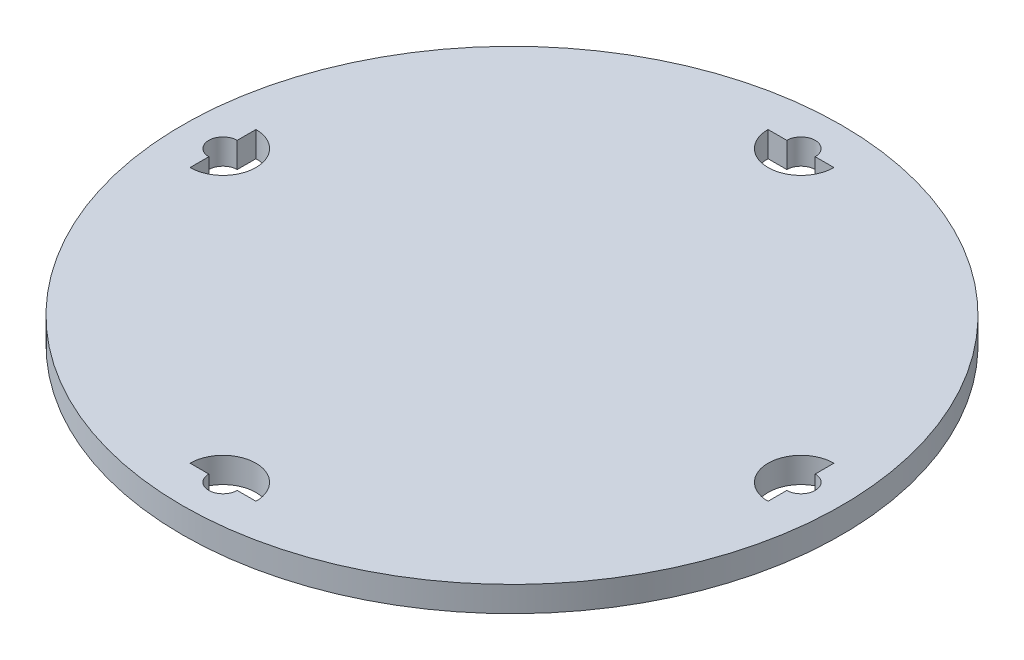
ISO-10303-21;
HEADER;
FILE_DESCRIPTION(('STEP AP214'),'2;1');
FILE_NAME('part.step','',(''),(''),'','','');
FILE_SCHEMA(('AUTOMOTIVE_DESIGN { 1 0 10303 214 1 1 1 1 }'));
ENDSEC;
DATA;
#1=APPLICATION_CONTEXT('core data for automotive mechanical design processes');
#2=APPLICATION_PROTOCOL_DEFINITION('international standard','automotive_design',2000,#1);
#3=PRODUCT_CONTEXT('',#1,'mechanical');
#4=PRODUCT('Part','Part','',(#3));
#5=PRODUCT_RELATED_PRODUCT_CATEGORY('part','',(#4));
#6=PRODUCT_DEFINITION_FORMATION('','',#4);
#7=PRODUCT_DEFINITION_CONTEXT('part definition',#1,'design');
#8=PRODUCT_DEFINITION('design','',#6,#7);
#9=PRODUCT_DEFINITION_SHAPE('','',#8);
#10=(LENGTH_UNIT() NAMED_UNIT(*) SI_UNIT(.MILLI.,.METRE.));
#11=(NAMED_UNIT(*) PLANE_ANGLE_UNIT() SI_UNIT($,.RADIAN.));
#12=(NAMED_UNIT(*) SI_UNIT($,.STERADIAN.) SOLID_ANGLE_UNIT());
#13=UNCERTAINTY_MEASURE_WITH_UNIT(LENGTH_MEASURE(1.E-05),#10,'distance_accuracy_value','');
#14=(GEOMETRIC_REPRESENTATION_CONTEXT(3) GLOBAL_UNCERTAINTY_ASSIGNED_CONTEXT((#13)) GLOBAL_UNIT_ASSIGNED_CONTEXT((#10,
#11,#12)) REPRESENTATION_CONTEXT('',''));
#15=CARTESIAN_POINT('',(0.,0.,0.));
#16=DIRECTION('',(0.,0.,1.));
#17=DIRECTION('',(1.,0.,0.));
#18=AXIS2_PLACEMENT_3D('',#15,#16,#17);
#19=CARTESIAN_POINT('',(0.,6.35,0.));
#20=DIRECTION('',(0.,-1.,0.));
#21=DIRECTION('',(0.,0.,-1.));
#22=AXIS2_PLACEMENT_3D('',#19,#20,#21);
#23=CYLINDRICAL_SURFACE('',#22,82.55);
#24=CARTESIAN_POINT('',(0.,6.35,0.));
#25=DIRECTION('',(0.,1.,0.));
#26=DIRECTION('',(0.,0.,1.));
#27=AXIS2_PLACEMENT_3D('',#24,#25,#26);
#28=CIRCLE('',#27,82.55);
#29=CARTESIAN_POINT('',(0.,6.35,82.55));
#30=VERTEX_POINT('',#29);
#31=EDGE_CURVE('E11',#30,#30,#28,.T.);
#32=ORIENTED_EDGE('',*,*,#31,.F.);
#33=EDGE_LOOP('',(#32));
#34=FACE_BOUND('',#33,.T.);
#35=CARTESIAN_POINT('',(0.,0.,0.));
#36=DIRECTION('',(0.,1.,0.));
#37=DIRECTION('',(0.,0.,1.));
#38=AXIS2_PLACEMENT_3D('',#35,#36,#37);
#39=CIRCLE('',#38,82.55);
#40=CARTESIAN_POINT('',(0.,0.,82.55));
#41=VERTEX_POINT('',#40);
#42=EDGE_CURVE('E46',#41,#41,#39,.T.);
#43=ORIENTED_EDGE('',*,*,#42,.T.);
#44=EDGE_LOOP('',(#43));
#45=FACE_BOUND('',#44,.T.);
#46=ADVANCED_FACE('F43',(#34,#45),#23,.T.);
#47=CARTESIAN_POINT('',(0.,6.35,0.));
#48=DIRECTION('',(0.,1.,0.));
#49=DIRECTION('',(0.,0.,1.));
#50=AXIS2_PLACEMENT_3D('',#47,#48,#49);
#51=PLANE('',#50);
#52=CARTESIAN_POINT('',(72.39,6.35,-2.52748334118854E-13));
#53=DIRECTION('',(0.,1.,0.));
#54=DIRECTION('',(1.,0.,0.));
#55=AXIS2_PLACEMENT_3D('',#52,#53,#54);
#56=CIRCLE('',#55,8.255);
#57=CARTESIAN_POINT('',(72.39,6.35,8.25499999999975));
#58=VERTEX_POINT('',#57);
#59=CARTESIAN_POINT('',(72.39,6.35,-8.25500000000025));
#60=VERTEX_POINT('',#59);
#61=EDGE_CURVE('E172',#58,#60,#56,.F.);
#62=ORIENTED_EDGE('',*,*,#61,.T.);
#63=DIRECTION('',(0.,0.,-1.));
#64=VECTOR('',#63,1.);
#65=CARTESIAN_POINT('',(72.39,6.35,-2.52748334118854E-13));
#66=LINE('',#65,#64);
#67=CARTESIAN_POINT('',(72.39,6.35,-3.55600000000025));
#68=VERTEX_POINT('',#67);
#69=EDGE_CURVE('E157',#68,#60,#66,.T.);
#70=ORIENTED_EDGE('',*,*,#69,.F.);
#71=CARTESIAN_POINT('',(72.39,6.35,-2.52748334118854E-13));
#72=DIRECTION('',(0.,1.,0.));
#73=DIRECTION('',(1.,0.,0.));
#74=AXIS2_PLACEMENT_3D('',#71,#72,#73);
#75=CIRCLE('',#74,3.556);
#76=CARTESIAN_POINT('',(72.39,6.35,3.55599999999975));
#77=VERTEX_POINT('',#76);
#78=EDGE_CURVE('E57',#77,#68,#75,.T.);
#79=ORIENTED_EDGE('',*,*,#78,.F.);
#80=DIRECTION('',(0.,0.,1.));
#81=VECTOR('',#80,1.);
#82=CARTESIAN_POINT('',(72.39,6.35,-2.52748334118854E-13));
#83=LINE('',#82,#81);
#84=EDGE_CURVE('E180',#77,#58,#83,.T.);
#85=ORIENTED_EDGE('',*,*,#84,.T.);
#86=EDGE_LOOP('',(#62,#70,#79,#85));
#87=FACE_BOUND('',#86,.T.);
#88=CARTESIAN_POINT('',(0.,6.35,-72.39));
#89=DIRECTION('',(0.,1.,0.));
#90=DIRECTION('',(0.,0.,-1.));
#91=AXIS2_PLACEMENT_3D('',#88,#89,#90);
#92=CIRCLE('',#91,8.255);
#93=CARTESIAN_POINT('',(8.255,6.35,-72.39));
#94=VERTEX_POINT('',#93);
#95=CARTESIAN_POINT('',(-8.255,6.35,-72.39));
#96=VERTEX_POINT('',#95);
#97=EDGE_CURVE('E166',#94,#96,#92,.F.);
#98=ORIENTED_EDGE('',*,*,#97,.T.);
#99=DIRECTION('',(-1.,0.,0.));
#100=VECTOR('',#99,1.);
#101=CARTESIAN_POINT('',(0.,6.35,-72.39));
#102=LINE('',#101,#100);
#103=CARTESIAN_POINT('',(-3.556,6.35,-72.39));
#104=VERTEX_POINT('',#103);
#105=EDGE_CURVE('E188',#104,#96,#102,.T.);
#106=ORIENTED_EDGE('',*,*,#105,.F.);
#107=CARTESIAN_POINT('',(0.,6.35,-72.39));
#108=DIRECTION('',(0.,1.,0.));
#109=DIRECTION('',(0.,0.,-1.));
#110=AXIS2_PLACEMENT_3D('',#107,#108,#109);
#111=CIRCLE('',#110,3.556);
#112=CARTESIAN_POINT('',(3.556,6.35,-72.39));
#113=VERTEX_POINT('',#112);
#114=EDGE_CURVE('E65',#113,#104,#111,.T.);
#115=ORIENTED_EDGE('',*,*,#114,.F.);
#116=DIRECTION('',(1.,0.,0.));
#117=VECTOR('',#116,1.);
#118=CARTESIAN_POINT('',(0.,6.35,-72.39));
#119=LINE('',#118,#117);
#120=EDGE_CURVE('E211',#113,#94,#119,.T.);
#121=ORIENTED_EDGE('',*,*,#120,.T.);
#122=EDGE_LOOP('',(#98,#106,#115,#121));
#123=FACE_BOUND('',#122,.T.);
#124=CARTESIAN_POINT('',(-72.39,6.35,7.58245002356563E-13));
#125=DIRECTION('',(0.,1.,0.));
#126=DIRECTION('',(-1.,0.,0.));
#127=AXIS2_PLACEMENT_3D('',#124,#125,#126);
#128=CIRCLE('',#127,8.255);
#129=CARTESIAN_POINT('',(-72.3900000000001,6.35,-8.25499999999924));
#130=VERTEX_POINT('',#129);
#131=CARTESIAN_POINT('',(-72.3899999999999,6.35,8.25500000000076));
#132=VERTEX_POINT('',#131);
#133=EDGE_CURVE('E191',#130,#132,#128,.F.);
#134=ORIENTED_EDGE('',*,*,#133,.T.);
#135=DIRECTION('',(0.,0.,1.));
#136=VECTOR('',#135,1.);
#137=CARTESIAN_POINT('',(-72.39,6.35,7.58245002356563E-13));
#138=LINE('',#137,#136);
#139=CARTESIAN_POINT('',(-72.3899999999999,6.35,3.55600000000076));
#140=VERTEX_POINT('',#139);
#141=EDGE_CURVE('E218',#140,#132,#138,.T.);
#142=ORIENTED_EDGE('',*,*,#141,.F.);
#143=CARTESIAN_POINT('',(-72.39,6.35,7.58245002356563E-13));
#144=DIRECTION('',(0.,1.,0.));
#145=DIRECTION('',(-1.,0.,0.));
#146=AXIS2_PLACEMENT_3D('',#143,#144,#145);
#147=CIRCLE('',#146,3.556);
#148=CARTESIAN_POINT('',(-72.39,6.35,-3.55599999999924));
#149=VERTEX_POINT('',#148);
#150=EDGE_CURVE('E229',#149,#140,#147,.T.);
#151=ORIENTED_EDGE('',*,*,#150,.F.);
#152=DIRECTION('',(0.,0.,-1.));
#153=VECTOR('',#152,1.);
#154=CARTESIAN_POINT('',(-72.39,6.35,7.58245002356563E-13));
#155=LINE('',#154,#153);
#156=EDGE_CURVE('E242',#149,#130,#155,.T.);
#157=ORIENTED_EDGE('',*,*,#156,.T.);
#158=EDGE_LOOP('',(#134,#142,#151,#157));
#159=FACE_BOUND('',#158,.T.);
#160=CARTESIAN_POINT('',(0.,6.35,72.39));
#161=DIRECTION('',(0.,1.,0.));
#162=DIRECTION('',(0.,0.,1.));
#163=AXIS2_PLACEMENT_3D('',#160,#161,#162);
#164=CIRCLE('',#163,8.255);
#165=CARTESIAN_POINT('',(-8.255,6.35,72.39));
#166=VERTEX_POINT('',#165);
#167=CARTESIAN_POINT('',(8.255,6.35,72.39));
#168=VERTEX_POINT('',#167);
#169=EDGE_CURVE('E251',#166,#168,#164,.F.);
#170=ORIENTED_EDGE('',*,*,#169,.T.);
#171=DIRECTION('',(1.,0.,0.));
#172=VECTOR('',#171,1.);
#173=CARTESIAN_POINT('',(0.,6.35,72.39));
#174=LINE('',#173,#172);
#175=CARTESIAN_POINT('',(3.556,6.35,72.39));
#176=VERTEX_POINT('',#175);
#177=EDGE_CURVE('E274',#176,#168,#174,.T.);
#178=ORIENTED_EDGE('',*,*,#177,.F.);
#179=CARTESIAN_POINT('',(0.,6.35,72.39));
#180=DIRECTION('',(0.,1.,0.));
#181=DIRECTION('',(0.,0.,1.));
#182=AXIS2_PLACEMENT_3D('',#179,#180,#181);
#183=CIRCLE('',#182,3.556);
#184=CARTESIAN_POINT('',(-3.556,6.35,72.39));
#185=VERTEX_POINT('',#184);
#186=EDGE_CURVE('E181',#185,#176,#183,.T.);
#187=ORIENTED_EDGE('',*,*,#186,.F.);
#188=DIRECTION('',(-1.,0.,0.));
#189=VECTOR('',#188,1.);
#190=CARTESIAN_POINT('',(0.,6.35,72.39));
#191=LINE('',#190,#189);
#192=EDGE_CURVE('E183',#185,#166,#191,.T.);
#193=ORIENTED_EDGE('',*,*,#192,.T.);
#194=EDGE_LOOP('',(#170,#178,#187,#193));
#195=FACE_BOUND('',#194,.T.);
#196=ORIENTED_EDGE('',*,*,#31,.T.);
#197=EDGE_LOOP('',(#196));
#198=FACE_BOUND('',#197,.T.);
#199=ADVANCED_FACE('F177',(#87,#123,#159,#195,#198),#51,.T.);
#200=CARTESIAN_POINT('',(0.,0.,0.));
#201=DIRECTION('',(0.,1.,0.));
#202=DIRECTION('',(0.,0.,1.));
#203=AXIS2_PLACEMENT_3D('',#200,#201,#202);
#204=PLANE('',#203);
#205=DIRECTION('',(0.,0.,-1.));
#206=VECTOR('',#205,1.);
#207=CARTESIAN_POINT('',(72.39,0.,-2.52748334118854E-13));
#208=LINE('',#207,#206);
#209=CARTESIAN_POINT('',(72.39,0.,-3.55600000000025));
#210=VERTEX_POINT('',#209);
#211=CARTESIAN_POINT('',(72.39,0.,-8.25500000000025));
#212=VERTEX_POINT('',#211);
#213=EDGE_CURVE('E165',#210,#212,#208,.T.);
#214=ORIENTED_EDGE('',*,*,#213,.T.);
#215=CARTESIAN_POINT('',(72.39,0.,-2.52748334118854E-13));
#216=DIRECTION('',(0.,1.,0.));
#217=DIRECTION('',(1.,0.,0.));
#218=AXIS2_PLACEMENT_3D('',#215,#216,#217);
#219=CIRCLE('',#218,8.255);
#220=CARTESIAN_POINT('',(72.39,0.,8.25499999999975));
#221=VERTEX_POINT('',#220);
#222=EDGE_CURVE('E175',#221,#212,#219,.F.);
#223=ORIENTED_EDGE('',*,*,#222,.F.);
#224=DIRECTION('',(0.,0.,1.));
#225=VECTOR('',#224,1.);
#226=CARTESIAN_POINT('',(72.39,0.,-2.52748334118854E-13));
#227=LINE('',#226,#225);
#228=CARTESIAN_POINT('',(72.39,0.,3.55599999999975));
#229=VERTEX_POINT('',#228);
#230=EDGE_CURVE('E487',#229,#221,#227,.T.);
#231=ORIENTED_EDGE('',*,*,#230,.F.);
#232=CARTESIAN_POINT('',(72.39,0.,-2.52748334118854E-13));
#233=DIRECTION('',(0.,1.,0.));
#234=DIRECTION('',(1.,0.,0.));
#235=AXIS2_PLACEMENT_3D('',#232,#233,#234);
#236=CIRCLE('',#235,3.556);
#237=EDGE_CURVE('E488',#229,#210,#236,.T.);
#238=ORIENTED_EDGE('',*,*,#237,.T.);
#239=EDGE_LOOP('',(#214,#223,#231,#238));
#240=FACE_BOUND('',#239,.T.);
#241=DIRECTION('',(-1.,0.,0.));
#242=VECTOR('',#241,1.);
#243=CARTESIAN_POINT('',(0.,0.,-72.39));
#244=LINE('',#243,#242);
#245=CARTESIAN_POINT('',(-3.556,0.,-72.39));
#246=VERTEX_POINT('',#245);
#247=CARTESIAN_POINT('',(-8.255,0.,-72.39));
#248=VERTEX_POINT('',#247);
#249=EDGE_CURVE('E190',#246,#248,#244,.T.);
#250=ORIENTED_EDGE('',*,*,#249,.T.);
#251=CARTESIAN_POINT('',(0.,0.,-72.39));
#252=DIRECTION('',(0.,1.,0.));
#253=DIRECTION('',(0.,0.,-1.));
#254=AXIS2_PLACEMENT_3D('',#251,#252,#253);
#255=CIRCLE('',#254,8.255);
#256=CARTESIAN_POINT('',(8.255,0.,-72.39));
#257=VERTEX_POINT('',#256);
#258=EDGE_CURVE('E214',#257,#248,#255,.F.);
#259=ORIENTED_EDGE('',*,*,#258,.F.);
#260=DIRECTION('',(1.,0.,0.));
#261=VECTOR('',#260,1.);
#262=CARTESIAN_POINT('',(0.,0.,-72.39));
#263=LINE('',#262,#261);
#264=CARTESIAN_POINT('',(3.556,0.,-72.39));
#265=VERTEX_POINT('',#264);
#266=EDGE_CURVE('E206',#265,#257,#263,.T.);
#267=ORIENTED_EDGE('',*,*,#266,.F.);
#268=CARTESIAN_POINT('',(0.,0.,-72.39));
#269=DIRECTION('',(0.,1.,0.));
#270=DIRECTION('',(0.,0.,-1.));
#271=AXIS2_PLACEMENT_3D('',#268,#269,#270);
#272=CIRCLE('',#271,3.556);
#273=EDGE_CURVE('E200',#265,#246,#272,.T.);
#274=ORIENTED_EDGE('',*,*,#273,.T.);
#275=EDGE_LOOP('',(#250,#259,#267,#274));
#276=FACE_BOUND('',#275,.T.);
#277=DIRECTION('',(0.,0.,1.));
#278=VECTOR('',#277,1.);
#279=CARTESIAN_POINT('',(-72.39,0.,7.58245002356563E-13));
#280=LINE('',#279,#278);
#281=CARTESIAN_POINT('',(-72.3899999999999,0.,3.55600000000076));
#282=VERTEX_POINT('',#281);
#283=CARTESIAN_POINT('',(-72.3899999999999,0.,8.25500000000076));
#284=VERTEX_POINT('',#283);
#285=EDGE_CURVE('E220',#282,#284,#280,.T.);
#286=ORIENTED_EDGE('',*,*,#285,.T.);
#287=CARTESIAN_POINT('',(-72.39,0.,7.58245002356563E-13));
#288=DIRECTION('',(0.,1.,0.));
#289=DIRECTION('',(-1.,0.,0.));
#290=AXIS2_PLACEMENT_3D('',#287,#288,#289);
#291=CIRCLE('',#290,8.255);
#292=CARTESIAN_POINT('',(-72.3900000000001,0.,-8.25499999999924));
#293=VERTEX_POINT('',#292);
#294=EDGE_CURVE('E245',#293,#284,#291,.F.);
#295=ORIENTED_EDGE('',*,*,#294,.F.);
#296=DIRECTION('',(0.,0.,-1.));
#297=VECTOR('',#296,1.);
#298=CARTESIAN_POINT('',(-72.39,0.,7.58245002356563E-13));
#299=LINE('',#298,#297);
#300=CARTESIAN_POINT('',(-72.39,0.,-3.55599999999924));
#301=VERTEX_POINT('',#300);
#302=EDGE_CURVE('E237',#301,#293,#299,.T.);
#303=ORIENTED_EDGE('',*,*,#302,.F.);
#304=CARTESIAN_POINT('',(-72.39,0.,7.58245002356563E-13));
#305=DIRECTION('',(0.,1.,0.));
#306=DIRECTION('',(-1.,0.,0.));
#307=AXIS2_PLACEMENT_3D('',#304,#305,#306);
#308=CIRCLE('',#307,3.556);
#309=EDGE_CURVE('E231',#301,#282,#308,.T.);
#310=ORIENTED_EDGE('',*,*,#309,.T.);
#311=EDGE_LOOP('',(#286,#295,#303,#310));
#312=FACE_BOUND('',#311,.T.);
#313=DIRECTION('',(1.,0.,0.));
#314=VECTOR('',#313,1.);
#315=CARTESIAN_POINT('',(0.,0.,72.39));
#316=LINE('',#315,#314);
#317=CARTESIAN_POINT('',(3.556,0.,72.39));
#318=VERTEX_POINT('',#317);
#319=CARTESIAN_POINT('',(8.255,0.,72.39));
#320=VERTEX_POINT('',#319);
#321=EDGE_CURVE('E262',#318,#320,#316,.T.);
#322=ORIENTED_EDGE('',*,*,#321,.T.);
#323=CARTESIAN_POINT('',(0.,0.,72.39));
#324=DIRECTION('',(0.,1.,0.));
#325=DIRECTION('',(0.,0.,1.));
#326=AXIS2_PLACEMENT_3D('',#323,#324,#325);
#327=CIRCLE('',#326,8.255);
#328=CARTESIAN_POINT('',(-8.255,0.,72.39));
#329=VERTEX_POINT('',#328);
#330=EDGE_CURVE('E254',#329,#320,#327,.F.);
#331=ORIENTED_EDGE('',*,*,#330,.F.);
#332=DIRECTION('',(-1.,0.,0.));
#333=VECTOR('',#332,1.);
#334=CARTESIAN_POINT('',(0.,0.,72.39));
#335=LINE('',#334,#333);
#336=CARTESIAN_POINT('',(-3.556,0.,72.39));
#337=VERTEX_POINT('',#336);
#338=EDGE_CURVE('E256',#337,#329,#335,.T.);
#339=ORIENTED_EDGE('',*,*,#338,.F.);
#340=CARTESIAN_POINT('',(0.,0.,72.39));
#341=DIRECTION('',(0.,1.,0.));
#342=DIRECTION('',(0.,0.,1.));
#343=AXIS2_PLACEMENT_3D('',#340,#341,#342);
#344=CIRCLE('',#343,3.556);
#345=EDGE_CURVE('E259',#337,#318,#344,.T.);
#346=ORIENTED_EDGE('',*,*,#345,.T.);
#347=EDGE_LOOP('',(#322,#331,#339,#346));
#348=FACE_BOUND('',#347,.T.);
#349=ORIENTED_EDGE('',*,*,#42,.F.);
#350=EDGE_LOOP('',(#349));
#351=FACE_BOUND('',#350,.T.);
#352=ADVANCED_FACE('F283',(#240,#276,#312,#348,#351),#204,.F.);
#353=CARTESIAN_POINT('',(0.,6.351,72.39));
#354=DIRECTION('',(0.,-1.,0.));
#355=DIRECTION('',(0.,0.,-1.));
#356=AXIS2_PLACEMENT_3D('',#353,#354,#355);
#357=CYLINDRICAL_SURFACE('',#356,8.255);
#358=DIRECTION('',(0.,-1.,0.));
#359=VECTOR('',#358,1.);
#360=CARTESIAN_POINT('',(-8.255,6.351,72.39));
#361=LINE('',#360,#359);
#362=EDGE_CURVE('E272',#166,#329,#361,.T.);
#363=ORIENTED_EDGE('',*,*,#362,.T.);
#364=ORIENTED_EDGE('',*,*,#330,.T.);
#365=DIRECTION('',(0.,-1.,0.));
#366=VECTOR('',#365,1.);
#367=CARTESIAN_POINT('',(8.255,6.351,72.39));
#368=LINE('',#367,#366);
#369=EDGE_CURVE('E265',#168,#320,#368,.T.);
#370=ORIENTED_EDGE('',*,*,#369,.F.);
#371=ORIENTED_EDGE('',*,*,#169,.F.);
#372=EDGE_LOOP('',(#363,#364,#370,#371));
#373=FACE_BOUND('',#372,.T.);
#374=ADVANCED_FACE('F285',(#373),#357,.F.);
#375=CARTESIAN_POINT('',(0.,6.351,72.39));
#376=DIRECTION('',(0.,0.,1.));
#377=DIRECTION('',(1.,0.,0.));
#378=AXIS2_PLACEMENT_3D('',#375,#376,#377);
#379=PLANE('',#378);
#380=DIRECTION('',(0.,-1.,0.));
#381=VECTOR('',#380,1.);
#382=CARTESIAN_POINT('',(-3.556,6.351,72.39));
#383=LINE('',#382,#381);
#384=EDGE_CURVE('E270',#185,#337,#383,.T.);
#385=ORIENTED_EDGE('',*,*,#384,.T.);
#386=ORIENTED_EDGE('',*,*,#338,.T.);
#387=ORIENTED_EDGE('',*,*,#362,.F.);
#388=ORIENTED_EDGE('',*,*,#192,.F.);
#389=EDGE_LOOP('',(#385,#386,#387,#388));
#390=FACE_BOUND('',#389,.T.);
#391=ADVANCED_FACE('F291',(#390),#379,.F.);
#392=CARTESIAN_POINT('',(0.,6.351,72.39));
#393=DIRECTION('',(0.,-1.,0.));
#394=DIRECTION('',(0.,0.,-1.));
#395=AXIS2_PLACEMENT_3D('',#392,#393,#394);
#396=CYLINDRICAL_SURFACE('',#395,3.556);
#397=ORIENTED_EDGE('',*,*,#186,.T.);
#398=DIRECTION('',(0.,-1.,0.));
#399=VECTOR('',#398,1.);
#400=CARTESIAN_POINT('',(3.556,6.351,72.39));
#401=LINE('',#400,#399);
#402=EDGE_CURVE('E268',#176,#318,#401,.T.);
#403=ORIENTED_EDGE('',*,*,#402,.T.);
#404=ORIENTED_EDGE('',*,*,#345,.F.);
#405=ORIENTED_EDGE('',*,*,#384,.F.);
#406=EDGE_LOOP('',(#397,#403,#404,#405));
#407=FACE_BOUND('',#406,.T.);
#408=ADVANCED_FACE('F323',(#407),#396,.F.);
#409=CARTESIAN_POINT('',(0.,6.351,72.39));
#410=DIRECTION('',(0.,0.,-1.));
#411=DIRECTION('',(-1.,0.,0.));
#412=AXIS2_PLACEMENT_3D('',#409,#410,#411);
#413=PLANE('',#412);
#414=ORIENTED_EDGE('',*,*,#177,.T.);
#415=ORIENTED_EDGE('',*,*,#369,.T.);
#416=ORIENTED_EDGE('',*,*,#321,.F.);
#417=ORIENTED_EDGE('',*,*,#402,.F.);
#418=EDGE_LOOP('',(#414,#415,#416,#417));
#419=FACE_BOUND('',#418,.T.);
#420=ADVANCED_FACE('F332',(#419),#413,.T.);
#421=CARTESIAN_POINT('',(-72.39,6.351,7.58245002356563E-13));
#422=DIRECTION('',(0.,-1.,0.));
#423=DIRECTION('',(1.,0.,0.));
#424=AXIS2_PLACEMENT_3D('',#421,#422,#423);
#425=CYLINDRICAL_SURFACE('',#424,8.255);
#426=DIRECTION('',(0.,-1.,0.));
#427=VECTOR('',#426,1.);
#428=CARTESIAN_POINT('',(-72.3900000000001,6.351,-8.25499999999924));
#429=LINE('',#428,#427);
#430=EDGE_CURVE('E239',#130,#293,#429,.T.);
#431=ORIENTED_EDGE('',*,*,#430,.T.);
#432=ORIENTED_EDGE('',*,*,#294,.T.);
#433=DIRECTION('',(0.,-1.,0.));
#434=VECTOR('',#433,1.);
#435=CARTESIAN_POINT('',(-72.3899999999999,6.351,8.25500000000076));
#436=LINE('',#435,#434);
#437=EDGE_CURVE('E223',#132,#284,#436,.T.);
#438=ORIENTED_EDGE('',*,*,#437,.F.);
#439=ORIENTED_EDGE('',*,*,#133,.F.);
#440=EDGE_LOOP('',(#431,#432,#438,#439));
#441=FACE_BOUND('',#440,.T.);
#442=ADVANCED_FACE('F340',(#441),#425,.F.);
#443=CARTESIAN_POINT('',(-72.39,6.351,7.58245002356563E-13));
#444=DIRECTION('',(-1.,0.,0.));
#445=DIRECTION('',(0.,0.,1.));
#446=AXIS2_PLACEMENT_3D('',#443,#444,#445);
#447=PLANE('',#446);
#448=DIRECTION('',(0.,-1.,0.));
#449=VECTOR('',#448,1.);
#450=CARTESIAN_POINT('',(-72.39,6.351,-3.55599999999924));
#451=LINE('',#450,#449);
#452=EDGE_CURVE('E234',#149,#301,#451,.T.);
#453=ORIENTED_EDGE('',*,*,#452,.T.);
#454=ORIENTED_EDGE('',*,*,#302,.T.);
#455=ORIENTED_EDGE('',*,*,#430,.F.);
#456=ORIENTED_EDGE('',*,*,#156,.F.);
#457=EDGE_LOOP('',(#453,#454,#455,#456));
#458=FACE_BOUND('',#457,.T.);
#459=ADVANCED_FACE('F362',(#458),#447,.F.);
#460=CARTESIAN_POINT('',(-72.39,6.351,7.58245002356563E-13));
#461=DIRECTION('',(0.,-1.,0.));
#462=DIRECTION('',(1.,0.,0.));
#463=AXIS2_PLACEMENT_3D('',#460,#461,#462);
#464=CYLINDRICAL_SURFACE('',#463,3.556);
#465=ORIENTED_EDGE('',*,*,#150,.T.);
#466=DIRECTION('',(0.,-1.,0.));
#467=VECTOR('',#466,1.);
#468=CARTESIAN_POINT('',(-72.3899999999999,6.351,3.55600000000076));
#469=LINE('',#468,#467);
#470=EDGE_CURVE('E226',#140,#282,#469,.T.);
#471=ORIENTED_EDGE('',*,*,#470,.T.);
#472=ORIENTED_EDGE('',*,*,#309,.F.);
#473=ORIENTED_EDGE('',*,*,#452,.F.);
#474=EDGE_LOOP('',(#465,#471,#472,#473));
#475=FACE_BOUND('',#474,.T.);
#476=ADVANCED_FACE('F351',(#475),#464,.F.);
#477=CARTESIAN_POINT('',(-72.39,6.351,7.58245002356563E-13));
#478=DIRECTION('',(1.,0.,0.));
#479=DIRECTION('',(0.,0.,-1.));
#480=AXIS2_PLACEMENT_3D('',#477,#478,#479);
#481=PLANE('',#480);
#482=ORIENTED_EDGE('',*,*,#141,.T.);
#483=ORIENTED_EDGE('',*,*,#437,.T.);
#484=ORIENTED_EDGE('',*,*,#285,.F.);
#485=ORIENTED_EDGE('',*,*,#470,.F.);
#486=EDGE_LOOP('',(#482,#483,#484,#485));
#487=FACE_BOUND('',#486,.T.);
#488=ADVANCED_FACE('F346',(#487),#481,.T.);
#489=CARTESIAN_POINT('',(0.,6.351,-72.39));
#490=DIRECTION('',(0.,-1.,0.));
#491=DIRECTION('',(0.,0.,1.));
#492=AXIS2_PLACEMENT_3D('',#489,#490,#491);
#493=CYLINDRICAL_SURFACE('',#492,8.255);
#494=DIRECTION('',(0.,-1.,0.));
#495=VECTOR('',#494,1.);
#496=CARTESIAN_POINT('',(8.255,6.351,-72.39));
#497=LINE('',#496,#495);
#498=EDGE_CURVE('E208',#94,#257,#497,.T.);
#499=ORIENTED_EDGE('',*,*,#498,.T.);
#500=ORIENTED_EDGE('',*,*,#258,.T.);
#501=DIRECTION('',(0.,-1.,0.));
#502=VECTOR('',#501,1.);
#503=CARTESIAN_POINT('',(-8.255,6.351,-72.39));
#504=LINE('',#503,#502);
#505=EDGE_CURVE('E194',#96,#248,#504,.T.);
#506=ORIENTED_EDGE('',*,*,#505,.F.);
#507=ORIENTED_EDGE('',*,*,#97,.F.);
#508=EDGE_LOOP('',(#499,#500,#506,#507));
#509=FACE_BOUND('',#508,.T.);
#510=ADVANCED_FACE('F350',(#509),#493,.F.);
#511=CARTESIAN_POINT('',(0.,6.351,-72.39));
#512=DIRECTION('',(0.,0.,-1.));
#513=DIRECTION('',(-1.,0.,0.));
#514=AXIS2_PLACEMENT_3D('',#511,#512,#513);
#515=PLANE('',#514);
#516=DIRECTION('',(0.,-1.,0.));
#517=VECTOR('',#516,1.);
#518=CARTESIAN_POINT('',(3.556,6.351,-72.39));
#519=LINE('',#518,#517);
#520=EDGE_CURVE('E203',#113,#265,#519,.T.);
#521=ORIENTED_EDGE('',*,*,#520,.T.);
#522=ORIENTED_EDGE('',*,*,#266,.T.);
#523=ORIENTED_EDGE('',*,*,#498,.F.);
#524=ORIENTED_EDGE('',*,*,#120,.F.);
#525=EDGE_LOOP('',(#521,#522,#523,#524));
#526=FACE_BOUND('',#525,.T.);
#527=ADVANCED_FACE('F397',(#526),#515,.F.);
#528=CARTESIAN_POINT('',(0.,6.351,-72.39));
#529=DIRECTION('',(0.,-1.,0.));
#530=DIRECTION('',(0.,0.,1.));
#531=AXIS2_PLACEMENT_3D('',#528,#529,#530);
#532=CYLINDRICAL_SURFACE('',#531,3.556);
#533=ORIENTED_EDGE('',*,*,#114,.T.);
#534=DIRECTION('',(0.,-1.,0.));
#535=VECTOR('',#534,1.);
#536=CARTESIAN_POINT('',(-3.556,6.351,-72.39));
#537=LINE('',#536,#535);
#538=EDGE_CURVE('E197',#104,#246,#537,.T.);
#539=ORIENTED_EDGE('',*,*,#538,.T.);
#540=ORIENTED_EDGE('',*,*,#273,.F.);
#541=ORIENTED_EDGE('',*,*,#520,.F.);
#542=EDGE_LOOP('',(#533,#539,#540,#541));
#543=FACE_BOUND('',#542,.T.);
#544=ADVANCED_FACE('F386',(#543),#532,.F.);
#545=CARTESIAN_POINT('',(0.,6.351,-72.39));
#546=DIRECTION('',(0.,0.,1.));
#547=DIRECTION('',(1.,0.,0.));
#548=AXIS2_PLACEMENT_3D('',#545,#546,#547);
#549=PLANE('',#548);
#550=ORIENTED_EDGE('',*,*,#105,.T.);
#551=ORIENTED_EDGE('',*,*,#505,.T.);
#552=ORIENTED_EDGE('',*,*,#249,.F.);
#553=ORIENTED_EDGE('',*,*,#538,.F.);
#554=EDGE_LOOP('',(#550,#551,#552,#553));
#555=FACE_BOUND('',#554,.T.);
#556=ADVANCED_FACE('F382',(#555),#549,.T.);
#557=CARTESIAN_POINT('',(72.39,6.351,-2.52748334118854E-13));
#558=DIRECTION('',(0.,-1.,0.));
#559=DIRECTION('',(-1.,0.,0.));
#560=AXIS2_PLACEMENT_3D('',#557,#558,#559);
#561=CYLINDRICAL_SURFACE('',#560,8.255);
#562=DIRECTION('',(0.,-1.,0.));
#563=VECTOR('',#562,1.);
#564=CARTESIAN_POINT('',(72.39,6.351,8.25499999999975));
#565=LINE('',#564,#563);
#566=EDGE_CURVE('E491',#58,#221,#565,.T.);
#567=ORIENTED_EDGE('',*,*,#566,.T.);
#568=ORIENTED_EDGE('',*,*,#222,.T.);
#569=DIRECTION('',(0.,-1.,0.));
#570=VECTOR('',#569,1.);
#571=CARTESIAN_POINT('',(72.39,6.351,-8.25500000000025));
#572=LINE('',#571,#570);
#573=EDGE_CURVE('E160',#60,#212,#572,.T.);
#574=ORIENTED_EDGE('',*,*,#573,.F.);
#575=ORIENTED_EDGE('',*,*,#61,.F.);
#576=EDGE_LOOP('',(#567,#568,#574,#575));
#577=FACE_BOUND('',#576,.T.);
#578=ADVANCED_FACE('F171',(#577),#561,.F.);
#579=CARTESIAN_POINT('',(72.39,6.351,-2.52748334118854E-13));
#580=DIRECTION('',(1.,0.,0.));
#581=DIRECTION('',(0.,0.,-1.));
#582=AXIS2_PLACEMENT_3D('',#579,#580,#581);
#583=PLANE('',#582);
#584=DIRECTION('',(0.,-1.,0.));
#585=VECTOR('',#584,1.);
#586=CARTESIAN_POINT('',(72.39,6.351,3.55599999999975));
#587=LINE('',#586,#585);
#588=EDGE_CURVE('E485',#77,#229,#587,.T.);
#589=ORIENTED_EDGE('',*,*,#588,.T.);
#590=ORIENTED_EDGE('',*,*,#230,.T.);
#591=ORIENTED_EDGE('',*,*,#566,.F.);
#592=ORIENTED_EDGE('',*,*,#84,.F.);
#593=EDGE_LOOP('',(#589,#590,#591,#592));
#594=FACE_BOUND('',#593,.T.);
#595=ADVANCED_FACE('F427',(#594),#583,.F.);
#596=CARTESIAN_POINT('',(72.39,6.351,-2.52748334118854E-13));
#597=DIRECTION('',(0.,-1.,0.));
#598=DIRECTION('',(-1.,0.,0.));
#599=AXIS2_PLACEMENT_3D('',#596,#597,#598);
#600=CYLINDRICAL_SURFACE('',#599,3.556);
#601=ORIENTED_EDGE('',*,*,#78,.T.);
#602=DIRECTION('',(0.,-1.,0.));
#603=VECTOR('',#602,1.);
#604=CARTESIAN_POINT('',(72.39,6.351,-3.55600000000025));
#605=LINE('',#604,#603);
#606=EDGE_CURVE('E162',#68,#210,#605,.T.);
#607=ORIENTED_EDGE('',*,*,#606,.T.);
#608=ORIENTED_EDGE('',*,*,#237,.F.);
#609=ORIENTED_EDGE('',*,*,#588,.F.);
#610=EDGE_LOOP('',(#601,#607,#608,#609));
#611=FACE_BOUND('',#610,.T.);
#612=ADVANCED_FACE('F419',(#611),#600,.F.);
#613=CARTESIAN_POINT('',(72.39,6.351,-2.52748334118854E-13));
#614=DIRECTION('',(-1.,0.,0.));
#615=DIRECTION('',(0.,0.,1.));
#616=AXIS2_PLACEMENT_3D('',#613,#614,#615);
#617=PLANE('',#616);
#618=ORIENTED_EDGE('',*,*,#69,.T.);
#619=ORIENTED_EDGE('',*,*,#573,.T.);
#620=ORIENTED_EDGE('',*,*,#213,.F.);
#621=ORIENTED_EDGE('',*,*,#606,.F.);
#622=EDGE_LOOP('',(#618,#619,#620,#621));
#623=FACE_BOUND('',#622,.T.);
#624=ADVANCED_FACE('F159',(#623),#617,.T.);
#625=CLOSED_SHELL('',(#46,#199,#352,#374,#391,#408,#420,#442,#459,#476,#488,#510,#527,#544,#556,
#578,#595,#612,#624));
#626=MANIFOLD_SOLID_BREP('B2',#625);
#627=ADVANCED_BREP_SHAPE_REPRESENTATION('',(#18,#626),#14);
#628=SHAPE_DEFINITION_REPRESENTATION(#9,#627);
ENDSEC;
END-ISO-10303-21;
